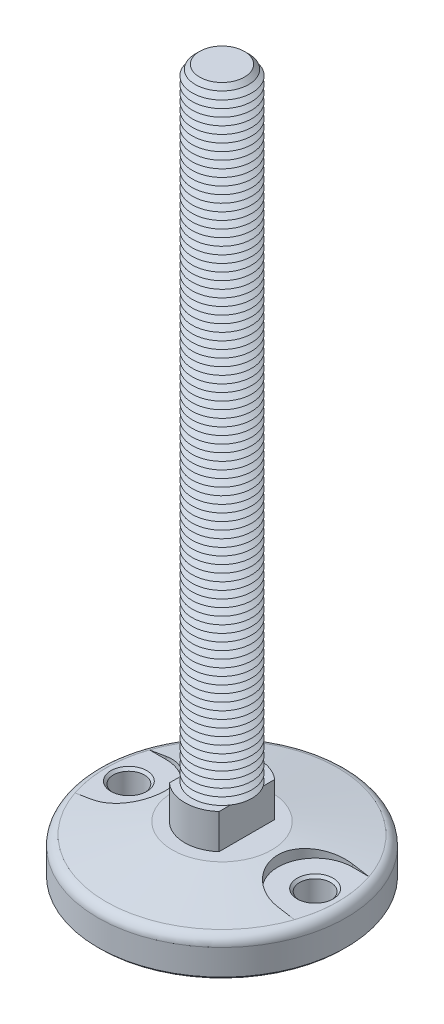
from build123d import *

# Parameters (mm, degrees)
FILLET1_R                = 4
SKETCH3_R                = 15
BOSS_EXTRUDE1_DEPTH      = 14
CUT_EXTRUDE1_START       = -14
CUT_EXTRUDE1_DEPTH       = 14
SKETCH5_R                = 12
BOSS_EXTRUDE2_DEPTH      = 250
CHAMFER1_SIZE            = 3
LPATTERN1_COUNT          = 83
LPATTERN1_PITCH          = 3
CUT_EXTRUDE4_DEPTH       = 4.7
SKETCH10_R               = 6.25
CUT_EXTRUDE5_DEPTH       = 15.3
CHAMFER2_SIZE            = 1
CHAMFER2_OF_MIRROR1_SIZE = 1
CHAMFER3_SIZE            = 1


with BuildPart() as part:
    # Sketch2 → Revolve1 (revolve)
    with BuildSketch(Plane(origin=(0, 0, 0), x_dir=(0, 0, -1), z_dir=(1, 0, 0))):
        Polygon((0, 0), (-20, 0), (-50, -5.289809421), (-50, -20), (0, -20), align=None)
    revolve(axis=Axis((0, 61.338865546, 0), (0, -1, 0)))

    # Fillet1
    fillet1_edges = [part.edges().sort_by_distance(p)[0] for p in [
        (0, -5.289809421, -50),
    ]]
    fillet(fillet1_edges, radius=FILLET1_R)

    # Sketch3 → Boss-Extrude1 (add)
    with BuildSketch(Plane(origin=(0, 0, 0), x_dir=(1, 0, 0), z_dir=(0, 1, 0))):
        with Locations(Location((0, 0, 0), (0, 0, 270))):
            Circle(SKETCH3_R)
    extrude(amount=BOSS_EXTRUDE1_DEPTH)

    # Sketch4 → Cut-Extrude1 (cut)
    with BuildSketch(Plane(origin=(0, 14, 0), x_dir=(1, 0, 0), z_dir=(0, 1, 0)).offset(CUT_EXTRUDE1_START)):
        with BuildLine():
            Line((-10, 11.180339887), (-10, -11.180339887))
            ThreePointArc((-10, -11.180339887), (-15, 0), (-10, 11.180339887))
        make_face()
        with BuildLine():
            Line((10, -11.180339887), (10, 11.180339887))
            ThreePointArc((10, 11.180339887), (15, 0), (10, -11.180339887))
        make_face()
    extrude(amount=CUT_EXTRUDE1_DEPTH, mode=Mode.SUBTRACT)

    # Sketch5 → Boss-Extrude2 (add)
    with BuildSketch(Plane(origin=(0, 14, 0), x_dir=(1, 0, 0), z_dir=(0, 1, 0))):
        with Locations(Location((0, 0, 0), (0, 0, 33.557309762))):
            Circle(SKETCH5_R)
    extrude(amount=BOSS_EXTRUDE2_DEPTH)

    # Chamfer1
    chamfer1_edges = [part.edges().sort_by_distance(p)[0] for p in [
        (-10, 264, 6.633249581),
    ]]
    chamfer(chamfer1_edges, length=CHAMFER1_SIZE)

    # Sketch6 → Cut-Revolve1 (revolve, cut)
    with BuildSketch(Plane(origin=(0, 0, 0), x_dir=(0, 0, -1), z_dir=(1, 0, 0))):
        Polygon((-12, 14), (-9.401923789, 15.5), (-12, 17), align=None)
    cut_revolve1 = revolve(axis=Axis((0, 61.338865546, 0), (0, -1, 0)), mode=Mode.SUBTRACT)

    # LPattern1: Cut-Revolve1 ×83
    with Locations(*[(0, i * LPATTERN1_PITCH, 0) for i in range(1, LPATTERN1_COUNT)]):
        add(cut_revolve1, mode=Mode.SUBTRACT)

    # Sketch8 → Cut-Extrude4 (cut)
    with BuildSketch(Plane(origin=(0, 0, 0), x_dir=(1, 0, 0), z_dir=(0, 1, 0))):
        with BuildLine():
            Line((-37.5, 15), (-44.219735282, 15))
            ThreePointArc((-44.219735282, 15), (-46.694592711, 0), (-44.219735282, -15))
            Line((-44.219735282, -15), (-37.5, -15))
            ThreePointArc((-37.5, -15), (-22.5, 0), (-37.5, 15))
        make_face()
    cut_extrude4 = extrude(amount=-CUT_EXTRUDE4_DEPTH, mode=Mode.SUBTRACT)

    # Sketch10 → Cut-Extrude5 (cut)
    with BuildSketch(Plane(origin=(0, -4.7, 0), x_dir=(1, 0, 0), z_dir=(0, 1, 0))):
        with Locations(Location((-37.5, 0, 0), (0, 0, 270))):
            Circle(SKETCH10_R)
    cut_extrude5 = extrude(amount=-CUT_EXTRUDE5_DEPTH, mode=Mode.SUBTRACT)

    # Chamfer2
    chamfer2_edges = [part.edges().sort_by_distance(p)[0] for p in [
        (-37.5, -4.7, -6.25),
        (-37.5, -20, -6.25),
    ]]
    chamfer(chamfer2_edges, length=CHAMFER2_SIZE)

    # Mirror1: Cut-Extrude4, Cut-Extrude5 across plane
    add(cut_extrude4.mirror(Plane(origin=(0, 0, 0), x_dir=(0, 0, 1), z_dir=(1, 0, 0))), mode=Mode.SUBTRACT)
    add(cut_extrude5.mirror(Plane(origin=(0, 0, 0), x_dir=(0, 0, 1), z_dir=(1, 0, 0))), mode=Mode.SUBTRACT)

    # Chamfer2 of Mirror1
    chamfer2_of_mirror1_edges = [part.edges().sort_by_distance(p)[0] for p in [
        (37.5, -4.7, -6.25),
        (37.5, -20, -6.25),
    ]]
    chamfer(chamfer2_of_mirror1_edges, length=CHAMFER2_OF_MIRROR1_SIZE)

    # Chamfer3
    chamfer3_edges = [part.edges().sort_by_distance(p)[0] for p in [
        (0, -20, -50),
    ]]
    chamfer(chamfer3_edges, length=CHAMFER3_SIZE)


solid = part.part
